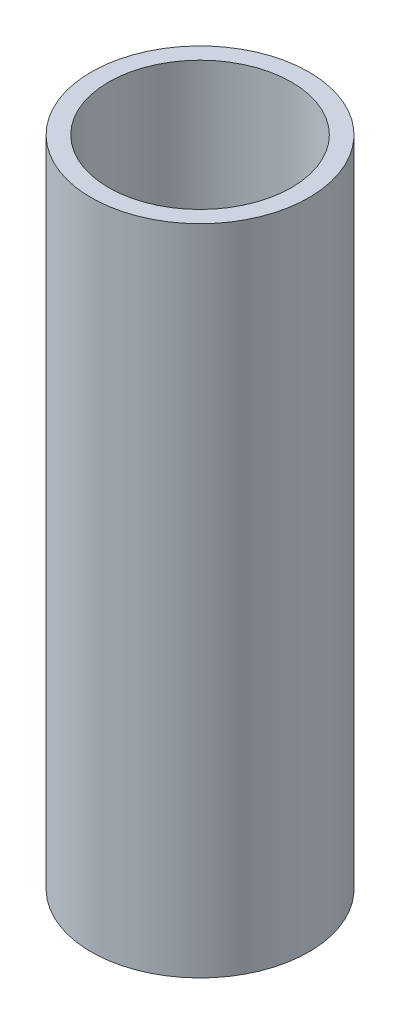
ISO-10303-21;
HEADER;
FILE_DESCRIPTION(('STEP AP214'),'2;1');
FILE_NAME('part.step','',(''),(''),'','','');
FILE_SCHEMA(('AUTOMOTIVE_DESIGN { 1 0 10303 214 1 1 1 1 }'));
ENDSEC;
DATA;
#1=APPLICATION_CONTEXT('core data for automotive mechanical design processes');
#2=APPLICATION_PROTOCOL_DEFINITION('international standard','automotive_design',2000,#1);
#3=PRODUCT_CONTEXT('',#1,'mechanical');
#4=PRODUCT('Part','Part','',(#3));
#5=PRODUCT_RELATED_PRODUCT_CATEGORY('part','',(#4));
#6=PRODUCT_DEFINITION_FORMATION('','',#4);
#7=PRODUCT_DEFINITION_CONTEXT('part definition',#1,'design');
#8=PRODUCT_DEFINITION('design','',#6,#7);
#9=PRODUCT_DEFINITION_SHAPE('','',#8);
#10=(LENGTH_UNIT() NAMED_UNIT(*) SI_UNIT(.MILLI.,.METRE.));
#11=(NAMED_UNIT(*) PLANE_ANGLE_UNIT() SI_UNIT($,.RADIAN.));
#12=(NAMED_UNIT(*) SI_UNIT($,.STERADIAN.) SOLID_ANGLE_UNIT());
#13=UNCERTAINTY_MEASURE_WITH_UNIT(LENGTH_MEASURE(1.E-05),#10,'distance_accuracy_value','');
#14=(GEOMETRIC_REPRESENTATION_CONTEXT(3) GLOBAL_UNCERTAINTY_ASSIGNED_CONTEXT((#13)) GLOBAL_UNIT_ASSIGNED_CONTEXT((#10,
#11,#12)) REPRESENTATION_CONTEXT('',''));
#15=CARTESIAN_POINT('',(0.,0.,0.));
#16=DIRECTION('',(0.,0.,1.));
#17=DIRECTION('',(1.,0.,0.));
#18=AXIS2_PLACEMENT_3D('',#15,#16,#17);
#19=CARTESIAN_POINT('',(0.,38.1,0.));
#20=DIRECTION('',(0.,-1.,0.));
#21=DIRECTION('',(0.,0.,-1.));
#22=AXIS2_PLACEMENT_3D('',#19,#20,#21);
#23=CYLINDRICAL_SURFACE('',#22,6.35);
#24=CARTESIAN_POINT('',(0.,12.7,0.));
#25=DIRECTION('',(0.,1.,0.));
#26=DIRECTION('',(0.,0.,1.));
#27=AXIS2_PLACEMENT_3D('',#24,#25,#26);
#28=CIRCLE('',#27,6.35);
#29=CARTESIAN_POINT('',(0.,12.7,-6.35));
#30=VERTEX_POINT('',#29);
#31=EDGE_CURVE('E39',#30,#30,#28,.T.);
#32=CARTESIAN_POINT('',(0.,-12.7,0.));
#33=DIRECTION('',(0.,-1.,0.));
#34=DIRECTION('',(0.,0.,-1.));
#35=AXIS2_PLACEMENT_3D('',#32,#33,#34);
#36=CIRCLE('',#35,6.35);
#37=CARTESIAN_POINT('',(0.,-12.7,-6.35));
#38=VERTEX_POINT('',#37);
#39=EDGE_CURVE('E35',#38,#38,#36,.T.);
#40=CARTESIAN_POINT('',(0.,12.7,-6.35));
#41=CARTESIAN_POINT('',(0.,12.4354166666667,-6.35));
#42=CARTESIAN_POINT('',(0.,12.1708333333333,-6.35));
#43=CARTESIAN_POINT('',(0.,11.6416666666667,-6.35));
#44=CARTESIAN_POINT('',(0.,11.3770833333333,-6.35));
#45=CARTESIAN_POINT('',(0.,10.8479166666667,-6.35));
#46=CARTESIAN_POINT('',(0.,10.5833333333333,-6.35));
#47=CARTESIAN_POINT('',(0.,10.0541666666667,-6.35));
#48=CARTESIAN_POINT('',(0.,9.78958333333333,-6.35));
#49=CARTESIAN_POINT('',(0.,9.26041666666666,-6.35));
#50=CARTESIAN_POINT('',(0.,8.99583333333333,-6.35));
#51=CARTESIAN_POINT('',(0.,8.46666666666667,-6.35));
#52=CARTESIAN_POINT('',(0.,8.20208333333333,-6.35));
#53=CARTESIAN_POINT('',(0.,7.67291666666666,-6.35));
#54=CARTESIAN_POINT('',(0.,7.40833333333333,-6.35));
#55=CARTESIAN_POINT('',(0.,6.87916666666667,-6.35));
#56=CARTESIAN_POINT('',(0.,6.61458333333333,-6.35));
#57=CARTESIAN_POINT('',(0.,6.08541666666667,-6.35));
#58=CARTESIAN_POINT('',(0.,5.82083333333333,-6.35));
#59=CARTESIAN_POINT('',(0.,5.29166666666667,-6.35));
#60=CARTESIAN_POINT('',(0.,5.02708333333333,-6.35));
#61=CARTESIAN_POINT('',(0.,4.49791666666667,-6.35));
#62=CARTESIAN_POINT('',(0.,4.23333333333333,-6.35));
#63=CARTESIAN_POINT('',(0.,3.70416666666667,-6.35));
#64=CARTESIAN_POINT('',(0.,3.43958333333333,-6.35));
#65=CARTESIAN_POINT('',(0.,2.91041666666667,-6.35));
#66=CARTESIAN_POINT('',(0.,2.64583333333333,-6.35));
#67=CARTESIAN_POINT('',(0.,2.11666666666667,-6.35));
#68=CARTESIAN_POINT('',(0.,1.85208333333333,-6.35));
#69=CARTESIAN_POINT('',(0.,1.32291666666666,-6.35));
#70=CARTESIAN_POINT('',(0.,1.05833333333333,-6.35));
#71=CARTESIAN_POINT('',(0.,0.529166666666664,-6.35));
#72=CARTESIAN_POINT('',(0.,0.264583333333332,-6.35));
#73=CARTESIAN_POINT('',(0.,-0.264583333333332,-6.35));
#74=CARTESIAN_POINT('',(0.,-0.529166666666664,-6.35));
#75=CARTESIAN_POINT('',(0.,-1.05833333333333,-6.35));
#76=CARTESIAN_POINT('',(0.,-1.32291666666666,-6.35));
#77=CARTESIAN_POINT('',(0.,-1.85208333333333,-6.35));
#78=CARTESIAN_POINT('',(0.,-2.11666666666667,-6.35));
#79=CARTESIAN_POINT('',(0.,-2.64583333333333,-6.35));
#80=CARTESIAN_POINT('',(0.,-2.91041666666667,-6.35));
#81=CARTESIAN_POINT('',(0.,-3.43958333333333,-6.35));
#82=CARTESIAN_POINT('',(0.,-3.70416666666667,-6.35));
#83=CARTESIAN_POINT('',(0.,-4.23333333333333,-6.35));
#84=CARTESIAN_POINT('',(0.,-4.49791666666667,-6.35));
#85=CARTESIAN_POINT('',(0.,-5.02708333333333,-6.35));
#86=CARTESIAN_POINT('',(0.,-5.29166666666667,-6.35));
#87=CARTESIAN_POINT('',(0.,-5.82083333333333,-6.35));
#88=CARTESIAN_POINT('',(0.,-6.08541666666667,-6.35));
#89=CARTESIAN_POINT('',(0.,-6.61458333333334,-6.35));
#90=CARTESIAN_POINT('',(0.,-6.87916666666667,-6.35));
#91=CARTESIAN_POINT('',(0.,-7.40833333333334,-6.35));
#92=CARTESIAN_POINT('',(0.,-7.67291666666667,-6.35));
#93=CARTESIAN_POINT('',(0.,-8.20208333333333,-6.35));
#94=CARTESIAN_POINT('',(0.,-8.46666666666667,-6.35));
#95=CARTESIAN_POINT('',(0.,-8.99583333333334,-6.35));
#96=CARTESIAN_POINT('',(0.,-9.26041666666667,-6.35));
#97=CARTESIAN_POINT('',(0.,-9.78958333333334,-6.35));
#98=CARTESIAN_POINT('',(0.,-10.0541666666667,-6.35));
#99=CARTESIAN_POINT('',(0.,-10.5833333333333,-6.35));
#100=CARTESIAN_POINT('',(0.,-10.8479166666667,-6.35));
#101=CARTESIAN_POINT('',(0.,-11.3770833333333,-6.35));
#102=CARTESIAN_POINT('',(0.,-11.6416666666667,-6.35));
#103=CARTESIAN_POINT('',(0.,-12.1708333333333,-6.35));
#104=CARTESIAN_POINT('',(0.,-12.4354166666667,-6.35));
#105=CARTESIAN_POINT('',(0.,-12.7,-6.35));
#106=B_SPLINE_CURVE_WITH_KNOTS('',3,(#40,#41,#42,#43,#44,#45,#46,#47,#48,#49,#50,#51,#52,#53,
#54,#55,#56,#57,#58,#59,#60,#61,#62,#63,#64,#65,#66,#67,#68,#69,#70,#71,#72,#73,#74,#75,#76,#77,
#78,#79,#80,#81,#82,#83,#84,#85,#86,#87,#88,#89,#90,#91,#92,#93,#94,#95,#96,#97,#98,#99,#100,
#101,#102,#103,#104,#105),.UNSPECIFIED.,.F.,.F.,(4,2,2,2,2,2,2,2,2,2,2,2,2,2,2,2,2,2,2,2,2,2,2,
2,2,2,2,2,2,2,2,2,4),(0.,0.793749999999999,1.5875,2.38125,3.175,3.96875,4.7625,5.55625,6.35,
7.14375,7.9375,8.73125,9.525,10.31875,11.1125,11.90625,12.7,13.49375,14.2875,15.08125,15.875,
16.66875,17.4625,18.25625,19.05,19.84375,20.6375,21.43125,22.225,23.01875,23.8125,24.60625,
25.4),.UNSPECIFIED.);
#107=EDGE_CURVE('BSEAM31',#30,#38,#106,.T.);
#108=ORIENTED_EDGE('',*,*,#31,.T.);
#109=ORIENTED_EDGE('',*,*,#39,.T.);
#110=ORIENTED_EDGE('',*,*,#107,.T.);
#111=ORIENTED_EDGE('',*,*,#107,.F.);
#112=EDGE_LOOP('',(#108,#110,#109,#111));
#113=FACE_BOUND('',#112,.T.);
#114=ADVANCED_FACE('F31',(#113),#23,.F.);
#115=CARTESIAN_POINT('',(0.,38.1,0.));
#116=DIRECTION('',(0.,1.,0.));
#117=DIRECTION('',(0.,0.,1.));
#118=AXIS2_PLACEMENT_3D('',#115,#116,#117);
#119=PLANE('',#118);
#120=CARTESIAN_POINT('',(0.,38.1,0.));
#121=DIRECTION('',(0.,1.,0.));
#122=DIRECTION('',(0.,0.,1.));
#123=AXIS2_PLACEMENT_3D('',#120,#121,#122);
#124=CIRCLE('',#123,10.668);
#125=CARTESIAN_POINT('',(0.,38.1,10.668));
#126=VERTEX_POINT('',#125);
#127=EDGE_CURVE('E46',#126,#126,#124,.T.);
#128=ORIENTED_EDGE('',*,*,#127,.F.);
#129=EDGE_LOOP('',(#128));
#130=FACE_BOUND('',#129,.T.);
#131=CARTESIAN_POINT('',(0.,38.1,0.));
#132=DIRECTION('',(0.,1.,0.));
#133=DIRECTION('',(0.,0.,1.));
#134=AXIS2_PLACEMENT_3D('',#131,#132,#133);
#135=CIRCLE('',#134,12.7);
#136=CARTESIAN_POINT('',(0.,38.1,-12.7));
#137=VERTEX_POINT('',#136);
#138=EDGE_CURVE('E10',#137,#137,#135,.T.);
#139=ORIENTED_EDGE('',*,*,#138,.T.);
#140=EDGE_LOOP('',(#139));
#141=FACE_BOUND('',#140,.T.);
#142=ADVANCED_FACE('F76',(#130,#141),#119,.T.);
#143=CARTESIAN_POINT('',(0.,38.1,0.));
#144=DIRECTION('',(0.,-1.,0.));
#145=DIRECTION('',(0.,0.,-1.));
#146=AXIS2_PLACEMENT_3D('',#143,#144,#145);
#147=CYLINDRICAL_SURFACE('',#146,12.7);
#148=CARTESIAN_POINT('',(0.,-38.1,0.));
#149=DIRECTION('',(0.,1.,0.));
#150=DIRECTION('',(0.,0.,1.));
#151=AXIS2_PLACEMENT_3D('',#148,#149,#150);
#152=CIRCLE('',#151,12.7);
#153=CARTESIAN_POINT('',(0.,-38.1,-12.7));
#154=VERTEX_POINT('',#153);
#155=EDGE_CURVE('E49',#154,#154,#152,.T.);
#156=CARTESIAN_POINT('',(0.,38.1,-12.7));
#157=CARTESIAN_POINT('',(0.,37.30625,-12.7));
#158=CARTESIAN_POINT('',(0.,36.5125,-12.7));
#159=CARTESIAN_POINT('',(0.,34.925,-12.7));
#160=CARTESIAN_POINT('',(0.,34.13125,-12.7));
#161=CARTESIAN_POINT('',(0.,32.54375,-12.7));
#162=CARTESIAN_POINT('',(0.,31.75,-12.7));
#163=CARTESIAN_POINT('',(0.,30.1625,-12.7));
#164=CARTESIAN_POINT('',(0.,29.36875,-12.7));
#165=CARTESIAN_POINT('',(0.,27.78125,-12.7));
#166=CARTESIAN_POINT('',(0.,26.9875,-12.7));
#167=CARTESIAN_POINT('',(0.,25.4,-12.7));
#168=CARTESIAN_POINT('',(0.,24.60625,-12.7));
#169=CARTESIAN_POINT('',(0.,23.01875,-12.7));
#170=CARTESIAN_POINT('',(0.,22.225,-12.7));
#171=CARTESIAN_POINT('',(0.,20.6375,-12.7));
#172=CARTESIAN_POINT('',(0.,19.84375,-12.7));
#173=CARTESIAN_POINT('',(0.,18.25625,-12.7));
#174=CARTESIAN_POINT('',(0.,17.4625,-12.7));
#175=CARTESIAN_POINT('',(0.,15.875,-12.7));
#176=CARTESIAN_POINT('',(0.,15.08125,-12.7));
#177=CARTESIAN_POINT('',(0.,13.49375,-12.7));
#178=CARTESIAN_POINT('',(0.,12.7,-12.7));
#179=CARTESIAN_POINT('',(0.,11.1125,-12.7));
#180=CARTESIAN_POINT('',(0.,10.31875,-12.7));
#181=CARTESIAN_POINT('',(0.,8.73124999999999,-12.7));
#182=CARTESIAN_POINT('',(0.,7.93749999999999,-12.7));
#183=CARTESIAN_POINT('',(0.,6.34999999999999,-12.7));
#184=CARTESIAN_POINT('',(0.,5.55625,-12.7));
#185=CARTESIAN_POINT('',(0.,3.96875,-12.7));
#186=CARTESIAN_POINT('',(0.,3.17499999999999,-12.7));
#187=CARTESIAN_POINT('',(0.,1.58749999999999,-12.7));
#188=CARTESIAN_POINT('',(0.,0.793749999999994,-12.7));
#189=CARTESIAN_POINT('',(0.,-0.793750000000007,-12.7));
#190=CARTESIAN_POINT('',(0.,-1.58750000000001,-12.7));
#191=CARTESIAN_POINT('',(0.,-3.17500000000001,-12.7));
#192=CARTESIAN_POINT('',(0.,-3.96875000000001,-12.7));
#193=CARTESIAN_POINT('',(0.,-5.55625000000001,-12.7));
#194=CARTESIAN_POINT('',(0.,-6.35000000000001,-12.7));
#195=CARTESIAN_POINT('',(0.,-7.93750000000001,-12.7));
#196=CARTESIAN_POINT('',(0.,-8.73125000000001,-12.7));
#197=CARTESIAN_POINT('',(0.,-10.31875,-12.7));
#198=CARTESIAN_POINT('',(0.,-11.1125,-12.7));
#199=CARTESIAN_POINT('',(0.,-12.7,-12.7));
#200=CARTESIAN_POINT('',(0.,-13.49375,-12.7));
#201=CARTESIAN_POINT('',(0.,-15.08125,-12.7));
#202=CARTESIAN_POINT('',(0.,-15.875,-12.7));
#203=CARTESIAN_POINT('',(0.,-17.4625,-12.7));
#204=CARTESIAN_POINT('',(0.,-18.25625,-12.7));
#205=CARTESIAN_POINT('',(0.,-19.84375,-12.7));
#206=CARTESIAN_POINT('',(0.,-20.6375,-12.7));
#207=CARTESIAN_POINT('',(0.,-22.225,-12.7));
#208=CARTESIAN_POINT('',(0.,-23.01875,-12.7));
#209=CARTESIAN_POINT('',(0.,-24.60625,-12.7));
#210=CARTESIAN_POINT('',(0.,-25.4,-12.7));
#211=CARTESIAN_POINT('',(0.,-26.9875,-12.7));
#212=CARTESIAN_POINT('',(0.,-27.78125,-12.7));
#213=CARTESIAN_POINT('',(0.,-29.36875,-12.7));
#214=CARTESIAN_POINT('',(0.,-30.1625,-12.7));
#215=CARTESIAN_POINT('',(0.,-31.75,-12.7));
#216=CARTESIAN_POINT('',(0.,-32.54375,-12.7));
#217=CARTESIAN_POINT('',(0.,-34.13125,-12.7));
#218=CARTESIAN_POINT('',(0.,-34.925,-12.7));
#219=CARTESIAN_POINT('',(0.,-36.5125,-12.7));
#220=CARTESIAN_POINT('',(0.,-37.30625,-12.7));
#221=CARTESIAN_POINT('',(0.,-38.1,-12.7));
#222=B_SPLINE_CURVE_WITH_KNOTS('',3,(#156,#157,#158,#159,#160,#161,#162,#163,#164,#165,#166,
#167,#168,#169,#170,#171,#172,#173,#174,#175,#176,#177,#178,#179,#180,#181,#182,#183,#184,#185,
#186,#187,#188,#189,#190,#191,#192,#193,#194,#195,#196,#197,#198,#199,#200,#201,#202,#203,#204,
#205,#206,#207,#208,#209,#210,#211,#212,#213,#214,#215,#216,#217,#218,#219,#220,#221),
.UNSPECIFIED.,.F.,.F.,(4,2,2,2,2,2,2,2,2,2,2,2,2,2,2,2,2,2,2,2,2,2,2,2,2,2,2,2,2,2,2,2,4),(0.,
2.38124999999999,4.7625,7.14375,9.525,11.90625,14.2875,16.66875,19.05,21.43125,23.8125,26.19375,
28.575,30.95625,33.3375,35.71875,38.1,40.48125,42.8625,45.24375,47.625,50.00625,52.3875,
54.76875,57.15,59.53125,61.9125,64.29375,66.675,69.05625,71.4375,73.81875,76.2),.UNSPECIFIED.);
#223=EDGE_CURVE('BSEAM33',#137,#154,#222,.T.);
#224=ORIENTED_EDGE('',*,*,#138,.F.);
#225=ORIENTED_EDGE('',*,*,#155,.T.);
#226=ORIENTED_EDGE('',*,*,#223,.T.);
#227=ORIENTED_EDGE('',*,*,#223,.F.);
#228=EDGE_LOOP('',(#224,#226,#225,#227));
#229=FACE_BOUND('',#228,.T.);
#230=ADVANCED_FACE('F33',(#229),#147,.T.);
#231=CARTESIAN_POINT('',(0.,12.7,0.));
#232=DIRECTION('',(0.,1.,0.));
#233=DIRECTION('',(0.,0.,1.));
#234=AXIS2_PLACEMENT_3D('',#231,#232,#233);
#235=CYLINDRICAL_SURFACE('',#234,10.668);
#236=CARTESIAN_POINT('',(0.,12.7,0.));
#237=DIRECTION('',(0.,1.,0.));
#238=DIRECTION('',(0.,0.,1.));
#239=AXIS2_PLACEMENT_3D('',#236,#237,#238);
#240=CIRCLE('',#239,10.668);
#241=CARTESIAN_POINT('',(0.,12.7,10.668));
#242=VERTEX_POINT('',#241);
#243=EDGE_CURVE('E44',#242,#242,#240,.T.);
#244=ORIENTED_EDGE('',*,*,#243,.F.);
#245=EDGE_LOOP('',(#244));
#246=FACE_BOUND('',#245,.T.);
#247=ORIENTED_EDGE('',*,*,#127,.T.);
#248=EDGE_LOOP('',(#247));
#249=FACE_BOUND('',#248,.T.);
#250=ADVANCED_FACE('F84',(#246,#249),#235,.F.);
#251=CARTESIAN_POINT('',(0.,12.7,0.));
#252=DIRECTION('',(0.,1.,0.));
#253=DIRECTION('',(0.,0.,1.));
#254=AXIS2_PLACEMENT_3D('',#251,#252,#253);
#255=PLANE('',#254);
#256=ORIENTED_EDGE('',*,*,#31,.F.);
#257=EDGE_LOOP('',(#256));
#258=FACE_BOUND('',#257,.T.);
#259=ORIENTED_EDGE('',*,*,#243,.T.);
#260=EDGE_LOOP('',(#259));
#261=FACE_BOUND('',#260,.T.);
#262=ADVANCED_FACE('F87',(#258,#261),#255,.T.);
#263=CARTESIAN_POINT('',(0.,-38.1,0.));
#264=DIRECTION('',(0.,-1.,0.));
#265=DIRECTION('',(0.,0.,1.));
#266=AXIS2_PLACEMENT_3D('',#263,#264,#265);
#267=PLANE('',#266);
#268=CARTESIAN_POINT('',(0.,-38.1,0.));
#269=DIRECTION('',(0.,1.,0.));
#270=DIRECTION('',(0.,0.,1.));
#271=AXIS2_PLACEMENT_3D('',#268,#269,#270);
#272=CIRCLE('',#271,10.668);
#273=CARTESIAN_POINT('',(0.,-38.1,10.668));
#274=VERTEX_POINT('',#273);
#275=EDGE_CURVE('E54',#274,#274,#272,.T.);
#276=ORIENTED_EDGE('',*,*,#275,.T.);
#277=EDGE_LOOP('',(#276));
#278=FACE_BOUND('',#277,.T.);
#279=ORIENTED_EDGE('',*,*,#155,.F.);
#280=EDGE_LOOP('',(#279));
#281=FACE_BOUND('',#280,.T.);
#282=ADVANCED_FACE('F73',(#278,#281),#267,.T.);
#283=CARTESIAN_POINT('',(0.,-12.7,0.));
#284=DIRECTION('',(0.,-1.,0.));
#285=DIRECTION('',(0.,0.,-1.));
#286=AXIS2_PLACEMENT_3D('',#283,#284,#285);
#287=CYLINDRICAL_SURFACE('',#286,10.668);
#288=CARTESIAN_POINT('',(0.,-12.7,0.));
#289=DIRECTION('',(0.,1.,0.));
#290=DIRECTION('',(0.,0.,1.));
#291=AXIS2_PLACEMENT_3D('',#288,#289,#290);
#292=CIRCLE('',#291,10.668);
#293=CARTESIAN_POINT('',(0.,-12.7,10.668));
#294=VERTEX_POINT('',#293);
#295=EDGE_CURVE('E57',#294,#294,#292,.T.);
#296=ORIENTED_EDGE('',*,*,#295,.T.);
#297=EDGE_LOOP('',(#296));
#298=FACE_BOUND('',#297,.T.);
#299=ORIENTED_EDGE('',*,*,#275,.F.);
#300=EDGE_LOOP('',(#299));
#301=FACE_BOUND('',#300,.T.);
#302=ADVANCED_FACE('F68',(#298,#301),#287,.F.);
#303=CARTESIAN_POINT('',(0.,-12.7,0.));
#304=DIRECTION('',(0.,-1.,0.));
#305=DIRECTION('',(0.,0.,1.));
#306=AXIS2_PLACEMENT_3D('',#303,#304,#305);
#307=PLANE('',#306);
#308=ORIENTED_EDGE('',*,*,#39,.F.);
#309=EDGE_LOOP('',(#308));
#310=FACE_BOUND('',#309,.T.);
#311=ORIENTED_EDGE('',*,*,#295,.F.);
#312=EDGE_LOOP('',(#311));
#313=FACE_BOUND('',#312,.T.);
#314=ADVANCED_FACE('F65',(#310,#313),#307,.T.);
#315=CLOSED_SHELL('',(#114,#142,#230,#250,#262,#282,#302,#314));
#316=MANIFOLD_SOLID_BREP('B2',#315);
#317=ADVANCED_BREP_SHAPE_REPRESENTATION('',(#18,#316),#14);
#318=SHAPE_DEFINITION_REPRESENTATION(#9,#317);
ENDSEC;
END-ISO-10303-21;
